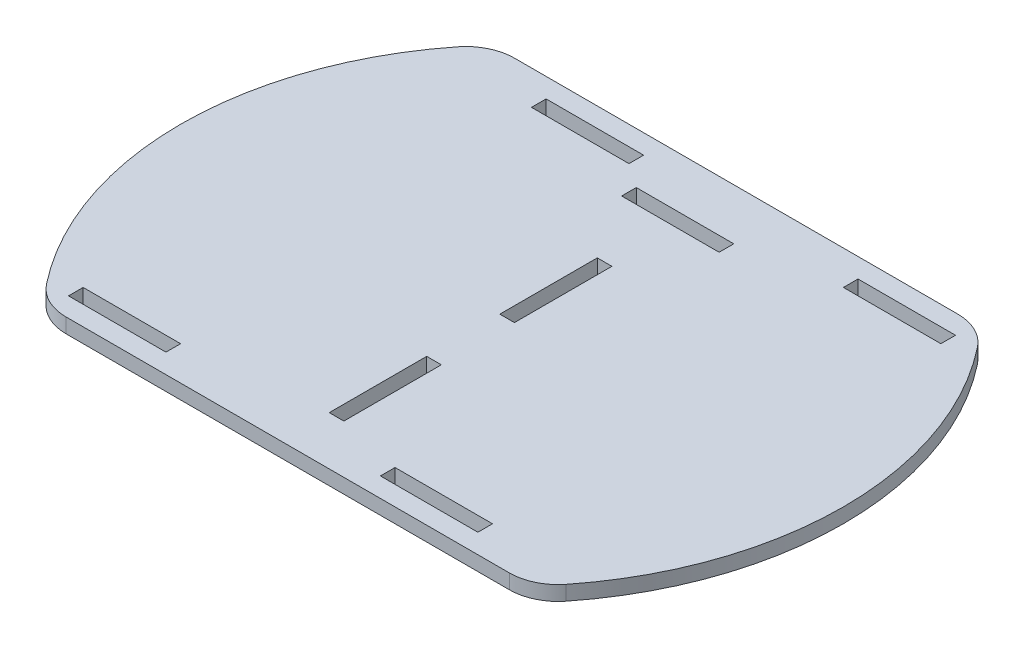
from build123d import *

# Parameters (mm, degrees)
BOSS_EXTRUDE1_DEPTH = 3
SKETCH2_W           = 20
SKETCH2_H           = 3
CUT_EXTRUDE1_DEPTH  = 10
SKETCH3_W           = 3
SKETCH3_H           = 20
CUT_EXTRUDE2_DEPTH  = 10
SKETCH4_W           = 127.048323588
SKETCH4_H           = 16.911590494
CUT_EXTRUDE3_DEPTH  = 3
CUT_EXTRUDE4_DEPTH  = 3
SKETCH6_W           = 20
SKETCH6_H           = 3
CUT_EXTRUDE5_DEPTH  = 3
FILLET1_R           = 10


with BuildPart() as part:
    # Sketch1 → Boss-Extrude1 (new body)
    with BuildSketch(Plane(origin=(0, 0, 0), x_dir=(1, 0, 0), z_dir=(0, 1, 0))):
        with BuildLine():
            Line((-52.048054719, 54), (52.048054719, 54))
            ThreePointArc((52.048054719, 54), (66.679796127, 34.33372669), (74.188947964, 11))
            ThreePointArc((74.188947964, 11), (75, 0), (74.188947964, -11))
            ThreePointArc((74.188947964, -11), (66.679796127, -34.33372669), (52.048054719, -54))
            Line((52.048054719, -54), (-52.048054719, -54))
            ThreePointArc((-52.048054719, -54), (-66.679796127, -34.33372669), (-74.188947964, -11))
            ThreePointArc((-74.188947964, -11), (-75, 0), (-74.188947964, 11))
            ThreePointArc((-74.188947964, 11), (-66.679796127, 34.33372669), (-52.048054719, 54))
        make_face()
    extrude(amount=BOSS_EXTRUDE1_DEPTH)

    # Sketch2 → Cut-Extrude1 (cut)
    with BuildSketch(Plane(origin=(0, 3, 0), x_dir=(1, 0, 0), z_dir=(0, 1, 0))):
        with Locations((-39, -40.5)):
            Rectangle(SKETCH2_W, SKETCH2_H)
        with Locations((25, -40.5)):
            Rectangle(SKETCH2_W, SKETCH2_H)
        with Locations((39, 40.5)):
            Rectangle(SKETCH2_W, SKETCH2_H)
        with Locations((-25, 40.5)):
            Rectangle(SKETCH2_W, SKETCH2_H)
    extrude(amount=-CUT_EXTRUDE1_DEPTH, mode=Mode.SUBTRACT)

    # Sketch3 → Cut-Extrude2 (cut)
    with BuildSketch(Plane(origin=(0, 3, 0), x_dir=(1, 0, 0), z_dir=(0, 1, 0))):
        with Locations((0, 9)):
            Rectangle(SKETCH3_W, SKETCH3_H)
        with Locations((0, -26)):
            Rectangle(SKETCH3_W, SKETCH3_H)
    extrude(amount=-CUT_EXTRUDE2_DEPTH, mode=Mode.SUBTRACT)

    # Sketch4 → Cut-Extrude3 (cut)
    with BuildSketch(Plane(origin=(0, 3, 0), x_dir=(1, 0, 0), z_dir=(0, 1, 0))):
        with Locations((1.325871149, -54.455795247)):
            Rectangle(SKETCH4_W, SKETCH4_H)
        with Locations((1.325871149, 54.455795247)):
            Rectangle(SKETCH4_W, SKETCH4_H)
    extrude(amount=-CUT_EXTRUDE3_DEPTH, mode=Mode.SUBTRACT)

    # Sketch5 → Cut-Extrude4 (cut)
    with BuildSketch(Plane(origin=(0, 3, 0), x_dir=(1, 0, 0), z_dir=(0, 1, 0))):
        with BuildLine():
            Line((-50.079936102, 46), (-86.910666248, 46))
            Line((-86.910666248, 46), (-86.910666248, -46))
            Line((-86.910666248, -46), (-50.079936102, -46))
            ThreePointArc((-50.079936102, -46), (-68, 0), (-50.079936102, 46))
        make_face()
        with BuildLine():
            Line((50.079936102, 46), (92.420261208, 46))
            Line((92.420261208, 46), (92.420261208, -46))
            Line((92.420261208, -46), (50.079936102, -46))
            ThreePointArc((50.079936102, -46), (68, 0), (50.079936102, 46))
        make_face()
    extrude(amount=-CUT_EXTRUDE4_DEPTH, mode=Mode.SUBTRACT)

    # Sketch6 → Cut-Extrude5 (cut)
    with BuildSketch(Plane(origin=(0, 3, 0), x_dir=(1, 0, 0), z_dir=(0, 1, 0))):
        with Locations((0, 34)):
            Rectangle(SKETCH6_W, SKETCH6_H)
    extrude(amount=-CUT_EXTRUDE5_DEPTH, mode=Mode.SUBTRACT)

    # Fillet1
    fillet1_edges = [part.edges().sort_by_distance(p)[0] for p in [
        (50.079936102, 1.5, -46),
        (50.079936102, 1.5, 46),
        (-50.079936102, 1.5, 46),
        (-50.079936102, 1.5, -46),
    ]]
    fillet(fillet1_edges, radius=FILLET1_R)


solid = part.part
